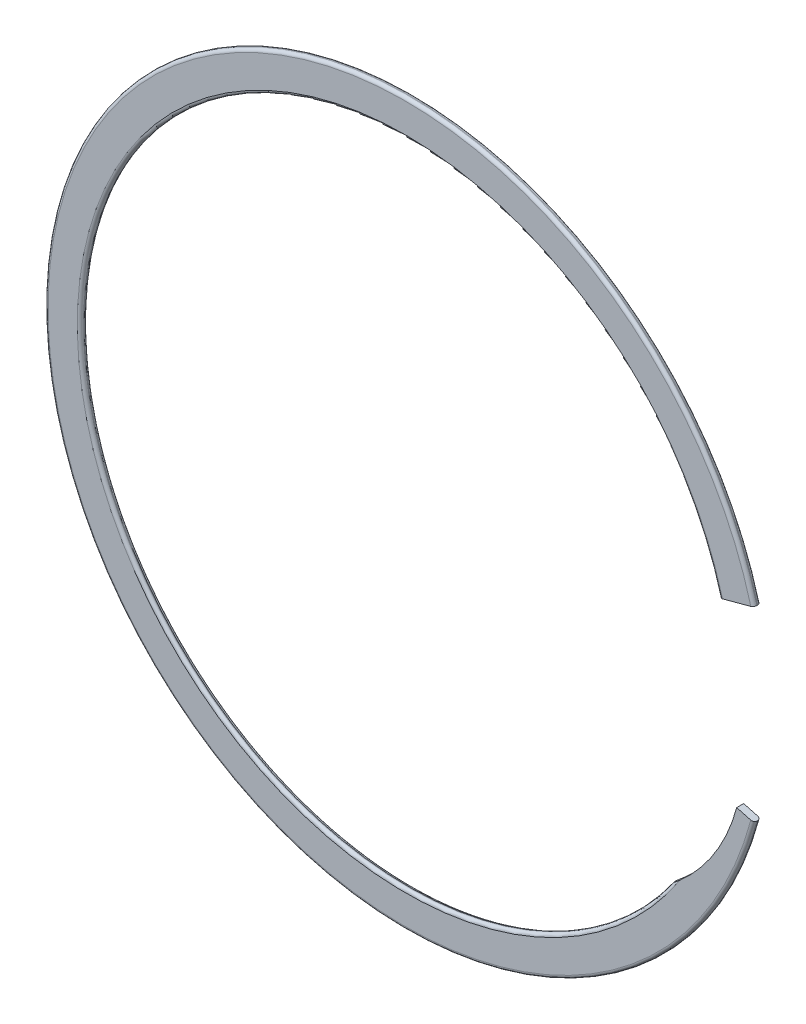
ISO-10303-21;
HEADER;
FILE_DESCRIPTION(('STEP AP214'),'2;1');
FILE_NAME('part.step','',(''),(''),'','','');
FILE_SCHEMA(('AUTOMOTIVE_DESIGN { 1 0 10303 214 1 1 1 1 }'));
ENDSEC;
DATA;
#1=APPLICATION_CONTEXT('core data for automotive mechanical design processes');
#2=APPLICATION_PROTOCOL_DEFINITION('international standard','automotive_design',2000,#1);
#3=PRODUCT_CONTEXT('',#1,'mechanical');
#4=PRODUCT('Part','Part','',(#3));
#5=PRODUCT_RELATED_PRODUCT_CATEGORY('part','',(#4));
#6=PRODUCT_DEFINITION_FORMATION('','',#4);
#7=PRODUCT_DEFINITION_CONTEXT('part definition',#1,'design');
#8=PRODUCT_DEFINITION('design','',#6,#7);
#9=PRODUCT_DEFINITION_SHAPE('','',#8);
#10=(LENGTH_UNIT() NAMED_UNIT(*) SI_UNIT(.MILLI.,.METRE.));
#11=(NAMED_UNIT(*) PLANE_ANGLE_UNIT() SI_UNIT($,.RADIAN.));
#12=(NAMED_UNIT(*) SI_UNIT($,.STERADIAN.) SOLID_ANGLE_UNIT());
#13=UNCERTAINTY_MEASURE_WITH_UNIT(LENGTH_MEASURE(1.E-05),#10,'distance_accuracy_value','');
#14=(GEOMETRIC_REPRESENTATION_CONTEXT(3) GLOBAL_UNCERTAINTY_ASSIGNED_CONTEXT((#13)) GLOBAL_UNIT_ASSIGNED_CONTEXT((#10,
#11,#12)) REPRESENTATION_CONTEXT('',''));
#15=CARTESIAN_POINT('',(0.,0.,0.));
#16=DIRECTION('',(0.,0.,1.));
#17=DIRECTION('',(1.,0.,0.));
#18=AXIS2_PLACEMENT_3D('',#15,#16,#17);
#19=CARTESIAN_POINT('',(0.,0.,0.3937));
#20=DIRECTION('',(0.,0.,-1.));
#21=DIRECTION('',(-1.,0.,0.));
#22=AXIS2_PLACEMENT_3D('',#19,#20,#21);
#23=CYLINDRICAL_SURFACE('',#22,36.7284);
#24=DIRECTION('',(0.,0.,-1.));
#25=VECTOR('',#24,1.);
#26=CARTESIAN_POINT('',(30.0454235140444,-21.1245802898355,0.3937));
#27=LINE('',#26,#25);
#28=CARTESIAN_POINT('',(30.0454235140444,-21.1245802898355,0.0393699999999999));
#29=VERTEX_POINT('',#28);
#30=CARTESIAN_POINT('',(30.0454235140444,-21.1245802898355,-0.0393699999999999));
#31=VERTEX_POINT('',#30);
#32=EDGE_CURVE('E127',#29,#31,#27,.T.);
#33=ORIENTED_EDGE('',*,*,#32,.T.);
#34=CARTESIAN_POINT('',(0.,0.,-0.0393699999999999));
#35=DIRECTION('',(0.,0.,1.));
#36=DIRECTION('',(1.,0.,0.));
#37=AXIS2_PLACEMENT_3D('',#34,#35,#36);
#38=CIRCLE('',#37,36.7284);
#39=CARTESIAN_POINT('',(35.4769101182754,9.50600941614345,-0.0393699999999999));
#40=VERTEX_POINT('',#39);
#41=EDGE_CURVE('E153',#31,#40,#38,.F.);
#42=ORIENTED_EDGE('',*,*,#41,.T.);
#43=DIRECTION('',(0.,0.,-1.));
#44=VECTOR('',#43,1.);
#45=CARTESIAN_POINT('',(35.4769101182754,9.50600941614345,0.3937));
#46=LINE('',#45,#44);
#47=CARTESIAN_POINT('',(35.4769101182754,9.50600941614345,0.0393699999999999));
#48=VERTEX_POINT('',#47);
#49=EDGE_CURVE('E148',#48,#40,#46,.T.);
#50=ORIENTED_EDGE('',*,*,#49,.F.);
#51=CARTESIAN_POINT('',(0.,0.,0.0393699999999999));
#52=DIRECTION('',(0.,0.,1.));
#53=DIRECTION('',(1.,0.,0.));
#54=AXIS2_PLACEMENT_3D('',#51,#52,#53);
#55=CIRCLE('',#54,36.7284);
#56=EDGE_CURVE('E151',#48,#29,#55,.T.);
#57=ORIENTED_EDGE('',*,*,#56,.T.);
#58=EDGE_LOOP('',(#33,#42,#50,#57));
#59=FACE_BOUND('',#58,.T.);
#60=ADVANCED_FACE('F36',(#59),#23,.F.);
#61=CARTESIAN_POINT('',(35.4769101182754,9.50600941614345,0.3937));
#62=DIRECTION('',(-0.258819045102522,0.965925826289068,0.));
#63=DIRECTION('',(-0.965925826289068,-0.258819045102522,0.));
#64=AXIS2_PLACEMENT_3D('',#61,#62,#63);
#65=PLANE('',#64);
#66=ORIENTED_EDGE('',*,*,#49,.T.);
#67=CARTESIAN_POINT('',(35.8191666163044,9.59771676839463,-0.0393699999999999));
#68=DIRECTION('',(-0.258819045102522,0.965925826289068,0.));
#69=DIRECTION('',(-0.965925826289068,-0.258819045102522,0.));
#70=AXIS2_PLACEMENT_3D('',#67,#68,#69);
#71=CIRCLE('',#70,0.35433);
#72=CARTESIAN_POINT('',(35.8191666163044,9.59771676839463,-0.3937));
#73=VERTEX_POINT('',#72);
#74=EDGE_CURVE('E162',#40,#73,#71,.F.);
#75=ORIENTED_EDGE('',*,*,#74,.T.);
#76=DIRECTION('',(0.965925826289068,0.258819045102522,0.));
#77=VECTOR('',#76,1.);
#78=CARTESIAN_POINT('',(35.4769101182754,9.50600941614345,-0.3937));
#79=LINE('',#78,#77);
#80=CARTESIAN_POINT('',(39.0111071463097,10.4529946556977,-0.3937));
#81=VERTEX_POINT('',#80);
#82=EDGE_CURVE('E138',#73,#81,#79,.T.);
#83=ORIENTED_EDGE('',*,*,#82,.T.);
#84=CARTESIAN_POINT('',(39.0111071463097,10.4529946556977,-0.0393699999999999));
#85=DIRECTION('',(-0.258819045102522,0.965925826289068,0.));
#86=DIRECTION('',(-0.965925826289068,-0.258819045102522,0.));
#87=AXIS2_PLACEMENT_3D('',#84,#85,#86);
#88=CIRCLE('',#87,0.35433);
#89=CARTESIAN_POINT('',(39.3533636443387,10.5447020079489,-0.0393699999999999));
#90=VERTEX_POINT('',#89);
#91=EDGE_CURVE('E158',#81,#90,#88,.F.);
#92=ORIENTED_EDGE('',*,*,#91,.T.);
#93=DIRECTION('',(0.,0.,-1.));
#94=VECTOR('',#93,1.);
#95=CARTESIAN_POINT('',(39.3533636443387,10.5447020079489,0.3937));
#96=LINE('',#95,#94);
#97=CARTESIAN_POINT('',(39.3533636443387,10.5447020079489,0.0393699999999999));
#98=VERTEX_POINT('',#97);
#99=EDGE_CURVE('E145',#98,#90,#96,.T.);
#100=ORIENTED_EDGE('',*,*,#99,.F.);
#101=CARTESIAN_POINT('',(39.0111071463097,10.4529946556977,0.0393699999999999));
#102=DIRECTION('',(-0.258819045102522,0.965925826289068,0.));
#103=DIRECTION('',(-0.965925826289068,-0.258819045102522,0.));
#104=AXIS2_PLACEMENT_3D('',#101,#102,#103);
#105=CIRCLE('',#104,0.35433);
#106=CARTESIAN_POINT('',(39.0111071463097,10.4529946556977,0.3937));
#107=VERTEX_POINT('',#106);
#108=EDGE_CURVE('E156',#98,#107,#105,.F.);
#109=ORIENTED_EDGE('',*,*,#108,.T.);
#110=DIRECTION('',(0.965925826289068,0.258819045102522,0.));
#111=VECTOR('',#110,1.);
#112=CARTESIAN_POINT('',(35.4769101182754,9.50600941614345,0.3937));
#113=LINE('',#112,#111);
#114=CARTESIAN_POINT('',(35.8191666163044,9.59771676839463,0.3937));
#115=VERTEX_POINT('',#114);
#116=EDGE_CURVE('E116',#115,#107,#113,.T.);
#117=ORIENTED_EDGE('',*,*,#116,.F.);
#118=CARTESIAN_POINT('',(35.8191666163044,9.59771676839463,0.0393699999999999));
#119=DIRECTION('',(-0.258819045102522,0.965925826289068,0.));
#120=DIRECTION('',(-0.965925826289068,-0.258819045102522,0.));
#121=AXIS2_PLACEMENT_3D('',#118,#119,#120);
#122=CIRCLE('',#121,0.35433);
#123=EDGE_CURVE('E160',#115,#48,#122,.F.);
#124=ORIENTED_EDGE('',*,*,#123,.T.);
#125=EDGE_LOOP('',(#66,#75,#83,#92,#100,#109,#117,#124));
#126=FACE_BOUND('',#125,.T.);
#127=ADVANCED_FACE('F194',(#126),#65,.F.);
#128=CARTESIAN_POINT('',(0.,0.,0.3937));
#129=DIRECTION('',(0.,0.,-1.));
#130=DIRECTION('',(-1.,0.,0.));
#131=AXIS2_PLACEMENT_3D('',#128,#129,#130);
#132=CYLINDRICAL_SURFACE('',#131,40.7416);
#133=ORIENTED_EDGE('',*,*,#99,.T.);
#134=CARTESIAN_POINT('',(0.,0.,-0.0393699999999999));
#135=DIRECTION('',(0.,0.,1.));
#136=DIRECTION('',(1.,0.,0.));
#137=AXIS2_PLACEMENT_3D('',#134,#135,#136);
#138=CIRCLE('',#137,40.7416);
#139=CARTESIAN_POINT('',(39.3533636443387,-10.5447020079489,-0.0393699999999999));
#140=VERTEX_POINT('',#139);
#141=EDGE_CURVE('E220',#90,#140,#138,.T.);
#142=ORIENTED_EDGE('',*,*,#141,.T.);
#143=DIRECTION('',(0.,0.,-1.));
#144=VECTOR('',#143,1.);
#145=CARTESIAN_POINT('',(39.3533636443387,-10.5447020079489,0.3937));
#146=LINE('',#145,#144);
#147=CARTESIAN_POINT('',(39.3533636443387,-10.5447020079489,0.0393699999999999));
#148=VERTEX_POINT('',#147);
#149=EDGE_CURVE('E126',#148,#140,#146,.T.);
#150=ORIENTED_EDGE('',*,*,#149,.F.);
#151=CARTESIAN_POINT('',(0.,0.,0.0393699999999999));
#152=DIRECTION('',(0.,0.,1.));
#153=DIRECTION('',(1.,0.,0.));
#154=AXIS2_PLACEMENT_3D('',#151,#152,#153);
#155=CIRCLE('',#154,40.7416);
#156=EDGE_CURVE('E216',#148,#98,#155,.F.);
#157=ORIENTED_EDGE('',*,*,#156,.T.);
#158=EDGE_LOOP('',(#133,#142,#150,#157));
#159=FACE_BOUND('',#158,.T.);
#160=ADVANCED_FACE('F191',(#159),#132,.T.);
#161=CARTESIAN_POINT('',(37.4151368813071,-10.0253557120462,0.3937));
#162=DIRECTION('',(-0.258819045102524,-0.965925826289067,0.));
#163=DIRECTION('',(0.965925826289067,-0.258819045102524,0.));
#164=AXIS2_PLACEMENT_3D('',#161,#162,#163);
#165=PLANE('',#164);
#166=ORIENTED_EDGE('',*,*,#149,.T.);
#167=CARTESIAN_POINT('',(39.0111071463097,-10.4529946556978,-0.0393699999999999));
#168=DIRECTION('',(-0.258819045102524,-0.965925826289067,0.));
#169=DIRECTION('',(0.965925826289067,-0.258819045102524,0.));
#170=AXIS2_PLACEMENT_3D('',#167,#168,#169);
#171=CIRCLE('',#170,0.35433);
#172=CARTESIAN_POINT('',(39.0111071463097,-10.4529946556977,-0.3937));
#173=VERTEX_POINT('',#172);
#174=EDGE_CURVE('E11',#140,#173,#171,.F.);
#175=ORIENTED_EDGE('',*,*,#174,.T.);
#176=DIRECTION('',(-0.965925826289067,0.258819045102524,0.));
#177=VECTOR('',#176,1.);
#178=CARTESIAN_POINT('',(37.4151368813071,-10.0253557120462,-0.3937));
#179=LINE('',#178,#177);
#180=CARTESIAN_POINT('',(37.4151368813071,-10.0253557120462,-0.3937));
#181=VERTEX_POINT('',#180);
#182=EDGE_CURVE('E122',#173,#181,#179,.T.);
#183=ORIENTED_EDGE('',*,*,#182,.T.);
#184=DIRECTION('',(0.,0.,-1.));
#185=VECTOR('',#184,1.);
#186=CARTESIAN_POINT('',(37.4151368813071,-10.0253557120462,0.3937));
#187=LINE('',#186,#185);
#188=CARTESIAN_POINT('',(37.4151368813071,-10.0253557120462,0.3937));
#189=VERTEX_POINT('',#188);
#190=EDGE_CURVE('E119',#189,#181,#187,.T.);
#191=ORIENTED_EDGE('',*,*,#190,.F.);
#192=DIRECTION('',(-0.965925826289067,0.258819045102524,0.));
#193=VECTOR('',#192,1.);
#194=CARTESIAN_POINT('',(37.4151368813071,-10.0253557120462,0.3937));
#195=LINE('',#194,#193);
#196=CARTESIAN_POINT('',(39.0111071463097,-10.4529946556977,0.3937));
#197=VERTEX_POINT('',#196);
#198=EDGE_CURVE('E106',#197,#189,#195,.T.);
#199=ORIENTED_EDGE('',*,*,#198,.F.);
#200=CARTESIAN_POINT('',(39.0111071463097,-10.4529946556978,0.0393699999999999));
#201=DIRECTION('',(-0.258819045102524,-0.965925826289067,0.));
#202=DIRECTION('',(0.965925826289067,-0.258819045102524,0.));
#203=AXIS2_PLACEMENT_3D('',#200,#201,#202);
#204=CIRCLE('',#203,0.35433);
#205=EDGE_CURVE('E44',#197,#148,#204,.F.);
#206=ORIENTED_EDGE('',*,*,#205,.T.);
#207=EDGE_LOOP('',(#166,#175,#183,#191,#199,#206));
#208=FACE_BOUND('',#207,.T.);
#209=ADVANCED_FACE('F120',(#208),#165,.F.);
#210=CARTESIAN_POINT('',(17.2242613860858,-4.61522692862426,0.3937));
#211=DIRECTION('',(0.,0.,-1.));
#212=DIRECTION('',(-1.,0.,0.));
#213=AXIS2_PLACEMENT_3D('',#210,#211,#212);
#214=CYLINDRICAL_SURFACE('',#213,20.9031324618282);
#215=CARTESIAN_POINT('',(17.2242613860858,-4.61522692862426,-0.3937));
#216=DIRECTION('',(0.,0.,-1.));
#217=DIRECTION('',(1.,0.,0.));
#218=AXIS2_PLACEMENT_3D('',#215,#216,#217);
#219=CIRCLE('',#218,20.9031324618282);
#220=CARTESIAN_POINT('',(31.0205199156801,-20.3188633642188,-0.3937));
#221=VERTEX_POINT('',#220);
#222=EDGE_CURVE('E142',#181,#221,#219,.T.);
#223=ORIENTED_EDGE('',*,*,#222,.T.);
#224=CARTESIAN_POINT('',(31.0205199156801,-20.3188633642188,-0.3937));
#225=CARTESIAN_POINT('',(30.9761520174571,-20.3578431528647,-0.39367635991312));
#226=CARTESIAN_POINT('',(30.9316104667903,-20.3966406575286,-0.392646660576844));
#227=CARTESIAN_POINT('',(30.8421947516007,-20.4738626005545,-0.388327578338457));
#228=CARTESIAN_POINT('',(30.7973201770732,-20.5122863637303,-0.38503467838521));
#229=CARTESIAN_POINT('',(30.7070594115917,-20.5889126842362,-0.375906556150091));
#230=CARTESIAN_POINT('',(30.6616718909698,-20.6271115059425,-0.370052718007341));
#231=CARTESIAN_POINT('',(30.5708829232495,-20.7028659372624,-0.355320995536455));
#232=CARTESIAN_POINT('',(30.5254815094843,-20.7404219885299,-0.346445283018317));
#233=CARTESIAN_POINT('',(30.4545207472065,-20.7986224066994,-0.32947622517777));
#234=CARTESIAN_POINT('',(30.4288779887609,-20.8195514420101,-0.322706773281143));
#235=CARTESIAN_POINT('',(30.377801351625,-20.8610390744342,-0.307649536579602));
#236=CARTESIAN_POINT('',(30.352367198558,-20.8815982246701,-0.299364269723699));
#237=CARTESIAN_POINT('',(30.3092904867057,-20.9162539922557,-0.283584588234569));
#238=CARTESIAN_POINT('',(30.2915636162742,-20.9304672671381,-0.276578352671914));
#239=CARTESIAN_POINT('',(30.2563380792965,-20.9586180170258,-0.261355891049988));
#240=CARTESIAN_POINT('',(30.2388399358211,-20.9725548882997,-0.253137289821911));
#241=CARTESIAN_POINT('',(30.2027879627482,-21.0011773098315,-0.234377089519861));
#242=CARTESIAN_POINT('',(30.1842744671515,-21.0158227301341,-0.223695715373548));
#243=CARTESIAN_POINT('',(30.1482506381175,-21.0442246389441,-0.199811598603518));
#244=CARTESIAN_POINT('',(30.1307364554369,-21.0579845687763,-0.186619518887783));
#245=CARTESIAN_POINT('',(30.1078462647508,-21.0759151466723,-0.165507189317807));
#246=CARTESIAN_POINT('',(30.1015502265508,-21.0808407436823,-0.159241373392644));
#247=CARTESIAN_POINT('',(30.0894386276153,-21.0903056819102,-0.145935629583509));
#248=CARTESIAN_POINT('',(30.0836245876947,-21.0948438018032,-0.138893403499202));
#249=CARTESIAN_POINT('',(30.0726662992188,-21.1033889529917,-0.12378388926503));
#250=CARTESIAN_POINT('',(30.0675340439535,-21.1073864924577,-0.11570220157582));
#251=CARTESIAN_POINT('',(30.0585287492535,-21.1143953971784,-0.0985304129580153));
#252=CARTESIAN_POINT('',(30.0546448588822,-21.1174152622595,-0.089449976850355));
#253=CARTESIAN_POINT('',(30.0497064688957,-21.1212534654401,-0.0735078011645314));
#254=CARTESIAN_POINT('',(30.0481410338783,-21.1224695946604,-0.0669055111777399));
#255=CARTESIAN_POINT('',(30.045981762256,-21.1241467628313,-0.0533405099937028));
#256=CARTESIAN_POINT('',(30.0454046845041,-21.1245947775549,-0.0463736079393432));
#257=CARTESIAN_POINT('',(30.0454235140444,-21.1245802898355,-0.0393699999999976));
#258=B_SPLINE_CURVE_WITH_KNOTS('',3,(#224,#225,#226,#227,#228,#229,#230,#231,#232,#233,#234,
#235,#236,#237,#238,#239,#240,#241,#242,#243,#244,#245,#246,#247,#248,#249,#250,#251,#252,#253,
#254,#255,#256,#257),.UNSPECIFIED.,.F.,.F.,(4,2,2,2,2,2,2,2,2,2,2,2,2,2,2,2,4),(0.,
0.177183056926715,0.354642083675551,0.533413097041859,0.712055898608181,0.813383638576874,
0.914544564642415,0.985851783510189,1.05730060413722,1.13495595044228,1.21228857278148,
1.24272476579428,1.27325360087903,1.30426333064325,1.33499573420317,1.35556401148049,
1.37647771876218),.UNSPECIFIED.);
#259=EDGE_CURVE('E174',#221,#31,#258,.T.);
#260=ORIENTED_EDGE('',*,*,#259,.T.);
#261=ORIENTED_EDGE('',*,*,#32,.F.);
#262=CARTESIAN_POINT('',(30.0454235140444,-21.1245802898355,0.0393699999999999));
#263=CARTESIAN_POINT('',(30.0454050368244,-21.1245945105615,0.046294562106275));
#264=CARTESIAN_POINT('',(30.0459691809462,-21.1241565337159,0.0531849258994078));
#265=CARTESIAN_POINT('',(30.0480843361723,-21.122513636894,0.0666201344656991));
#266=CARTESIAN_POINT('',(30.049620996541,-21.1213198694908,0.0731685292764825));
#267=CARTESIAN_POINT('',(30.0539891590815,-21.1179249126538,0.0874088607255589));
#268=CARTESIAN_POINT('',(30.0570458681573,-21.1155483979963,0.0949871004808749));
#269=CARTESIAN_POINT('',(30.0640736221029,-21.1100803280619,0.109461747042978));
#270=CARTESIAN_POINT('',(30.0680499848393,-21.1069846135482,0.116353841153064));
#271=CARTESIAN_POINT('',(30.0798331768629,-21.0978028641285,0.134378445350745));
#272=CARTESIAN_POINT('',(30.0882801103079,-21.0912123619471,0.144825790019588));
#273=CARTESIAN_POINT('',(30.1061922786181,-21.0772114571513,0.164143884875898));
#274=CARTESIAN_POINT('',(30.1156597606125,-21.0697992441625,0.173011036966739));
#275=CARTESIAN_POINT('',(30.1399026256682,-21.0507827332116,0.193542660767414));
#276=CARTESIAN_POINT('',(30.1550378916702,-21.0388791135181,0.20449689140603));
#277=CARTESIAN_POINT('',(30.1860063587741,-21.0144496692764,0.224602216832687));
#278=CARTESIAN_POINT('',(30.2018410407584,-21.0019225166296,0.233749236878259));
#279=CARTESIAN_POINT('',(30.2340874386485,-20.9763332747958,0.250772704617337));
#280=CARTESIAN_POINT('',(30.250503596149,-20.963266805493,0.258634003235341));
#281=CARTESIAN_POINT('',(30.2835675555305,-20.9368664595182,0.273253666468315));
#282=CARTESIAN_POINT('',(30.3002150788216,-20.9235328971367,0.280013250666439));
#283=CARTESIAN_POINT('',(30.3471577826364,-20.8858150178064,0.29774308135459));
#284=CARTESIAN_POINT('',(30.3776350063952,-20.8611882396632,0.307714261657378));
#285=CARTESIAN_POINT('',(30.4388295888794,-20.8114515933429,0.325507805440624));
#286=CARTESIAN_POINT('',(30.4695470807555,-20.786341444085,0.333328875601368));
#287=CARTESIAN_POINT('',(30.5620113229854,-20.7103114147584,0.354266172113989));
#288=CARTESIAN_POINT('',(30.6238891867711,-20.6588370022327,0.36479510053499));
#289=CARTESIAN_POINT('',(30.7419779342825,-20.5594334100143,0.380100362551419));
#290=CARTESIAN_POINT('',(30.7982103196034,-20.5115887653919,0.38529989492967));
#291=CARTESIAN_POINT('',(30.8820679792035,-20.439468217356,0.390394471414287));
#292=CARTESIAN_POINT('',(30.9098415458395,-20.4154544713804,0.391642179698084));
#293=CARTESIAN_POINT('',(30.9652713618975,-20.3672725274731,0.393293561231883));
#294=CARTESIAN_POINT('',(30.9929276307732,-20.3431043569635,0.393697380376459));
#295=CARTESIAN_POINT('',(31.0205199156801,-20.3188633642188,0.3937));
#296=B_SPLINE_CURVE_WITH_KNOTS('',3,(#262,#263,#264,#265,#266,#267,#268,#269,#270,#271,#272,
#273,#274,#275,#276,#277,#278,#279,#280,#281,#282,#283,#284,#285,#286,#287,#288,#289,#290,#291,
#292,#293,#294,#295),.UNSPECIFIED.,.F.,.F.,(4,2,2,2,2,2,2,2,2,2,2,2,2,2,2,2,4),(0.,
0.0206821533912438,0.0410660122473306,0.0664517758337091,0.0919881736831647,0.13662934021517,
0.181370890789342,0.247666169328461,0.31410926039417,0.381286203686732,0.448388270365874,
0.56959056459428,0.690865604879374,0.934131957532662,1.15608394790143,1.26628477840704,
1.37646655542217),.UNSPECIFIED.);
#297=CARTESIAN_POINT('',(31.0205199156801,-20.3188633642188,0.3937));
#298=VERTEX_POINT('',#297);
#299=EDGE_CURVE('E132',#29,#298,#296,.T.);
#300=ORIENTED_EDGE('',*,*,#299,.T.);
#301=CARTESIAN_POINT('',(17.2242613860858,-4.61522692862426,0.3937));
#302=DIRECTION('',(0.,0.,-1.));
#303=DIRECTION('',(1.,0.,0.));
#304=AXIS2_PLACEMENT_3D('',#301,#302,#303);
#305=CIRCLE('',#304,20.9031324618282);
#306=EDGE_CURVE('E111',#189,#298,#305,.T.);
#307=ORIENTED_EDGE('',*,*,#306,.F.);
#308=ORIENTED_EDGE('',*,*,#190,.T.);
#309=EDGE_LOOP('',(#223,#260,#261,#300,#307,#308));
#310=FACE_BOUND('',#309,.T.);
#311=ADVANCED_FACE('F129',(#310),#214,.F.);
#312=CARTESIAN_POINT('',(0.,0.,0.3937));
#313=DIRECTION('',(0.,0.,1.));
#314=DIRECTION('',(1.,0.,0.));
#315=AXIS2_PLACEMENT_3D('',#312,#313,#314);
#316=PLANE('',#315);
#317=ORIENTED_EDGE('',*,*,#306,.T.);
#318=CARTESIAN_POINT('',(0.,0.,0.3937));
#319=DIRECTION('',(0.,0.,1.));
#320=DIRECTION('',(1.,0.,0.));
#321=AXIS2_PLACEMENT_3D('',#318,#319,#320);
#322=CIRCLE('',#321,37.08273);
#323=EDGE_CURVE('E215',#298,#115,#322,.F.);
#324=ORIENTED_EDGE('',*,*,#323,.T.);
#325=ORIENTED_EDGE('',*,*,#116,.T.);
#326=CARTESIAN_POINT('',(0.,0.,0.3937));
#327=DIRECTION('',(0.,0.,1.));
#328=DIRECTION('',(1.,0.,0.));
#329=AXIS2_PLACEMENT_3D('',#326,#327,#328);
#330=CIRCLE('',#329,40.38727);
#331=EDGE_CURVE('E115',#107,#197,#330,.T.);
#332=ORIENTED_EDGE('',*,*,#331,.T.);
#333=ORIENTED_EDGE('',*,*,#198,.T.);
#334=EDGE_LOOP('',(#317,#324,#325,#332,#333));
#335=FACE_BOUND('',#334,.T.);
#336=ADVANCED_FACE('F108',(#335),#316,.T.);
#337=CARTESIAN_POINT('',(0.,0.,-0.3937));
#338=DIRECTION('',(0.,0.,1.));
#339=DIRECTION('',(1.,0.,0.));
#340=AXIS2_PLACEMENT_3D('',#337,#338,#339);
#341=PLANE('',#340);
#342=ORIENTED_EDGE('',*,*,#82,.F.);
#343=CARTESIAN_POINT('',(0.,0.,-0.3937));
#344=DIRECTION('',(0.,0.,1.));
#345=DIRECTION('',(1.,0.,0.));
#346=AXIS2_PLACEMENT_3D('',#343,#344,#345);
#347=CIRCLE('',#346,37.08273);
#348=EDGE_CURVE('E166',#73,#221,#347,.T.);
#349=ORIENTED_EDGE('',*,*,#348,.T.);
#350=ORIENTED_EDGE('',*,*,#222,.F.);
#351=ORIENTED_EDGE('',*,*,#182,.F.);
#352=CARTESIAN_POINT('',(0.,0.,-0.3937));
#353=DIRECTION('',(0.,0.,1.));
#354=DIRECTION('',(1.,0.,0.));
#355=AXIS2_PLACEMENT_3D('',#352,#353,#354);
#356=CIRCLE('',#355,40.38727);
#357=EDGE_CURVE('E164',#173,#81,#356,.F.);
#358=ORIENTED_EDGE('',*,*,#357,.T.);
#359=EDGE_LOOP('',(#342,#349,#350,#351,#358));
#360=FACE_BOUND('',#359,.T.);
#361=ADVANCED_FACE('F186',(#360),#341,.F.);
#362=CARTESIAN_POINT('',(0.,0.,-0.0393699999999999));
#363=DIRECTION('',(0.,0.,1.));
#364=DIRECTION('',(1.,0.,0.));
#365=AXIS2_PLACEMENT_3D('',#362,#363,#364);
#366=TOROIDAL_SURFACE('',#365,37.08273,0.35433);
#367=ORIENTED_EDGE('',*,*,#259,.F.);
#368=ORIENTED_EDGE('',*,*,#348,.F.);
#369=ORIENTED_EDGE('',*,*,#74,.F.);
#370=ORIENTED_EDGE('',*,*,#41,.F.);
#371=EDGE_LOOP('',(#367,#368,#369,#370));
#372=FACE_BOUND('',#371,.T.);
#373=ADVANCED_FACE('F201',(#372),#366,.T.);
#374=CARTESIAN_POINT('',(0.,0.,0.0393699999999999));
#375=DIRECTION('',(0.,0.,1.));
#376=DIRECTION('',(1.,0.,0.));
#377=AXIS2_PLACEMENT_3D('',#374,#375,#376);
#378=TOROIDAL_SURFACE('',#377,37.08273,0.35433);
#379=ORIENTED_EDGE('',*,*,#299,.F.);
#380=ORIENTED_EDGE('',*,*,#56,.F.);
#381=ORIENTED_EDGE('',*,*,#123,.F.);
#382=ORIENTED_EDGE('',*,*,#323,.F.);
#383=EDGE_LOOP('',(#379,#380,#381,#382));
#384=FACE_BOUND('',#383,.T.);
#385=ADVANCED_FACE('F180',(#384),#378,.T.);
#386=CARTESIAN_POINT('',(0.,0.,-0.0393699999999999));
#387=DIRECTION('',(0.,0.,1.));
#388=DIRECTION('',(1.,0.,0.));
#389=AXIS2_PLACEMENT_3D('',#386,#387,#388);
#390=TOROIDAL_SURFACE('',#389,40.38727,0.35433);
#391=ORIENTED_EDGE('',*,*,#91,.F.);
#392=ORIENTED_EDGE('',*,*,#357,.F.);
#393=ORIENTED_EDGE('',*,*,#174,.F.);
#394=ORIENTED_EDGE('',*,*,#141,.F.);
#395=EDGE_LOOP('',(#391,#392,#393,#394));
#396=FACE_BOUND('',#395,.T.);
#397=ADVANCED_FACE('F209',(#396),#390,.T.);
#398=CARTESIAN_POINT('',(0.,0.,0.0393699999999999));
#399=DIRECTION('',(0.,0.,1.));
#400=DIRECTION('',(1.,0.,0.));
#401=AXIS2_PLACEMENT_3D('',#398,#399,#400);
#402=TOROIDAL_SURFACE('',#401,40.38727,0.35433);
#403=ORIENTED_EDGE('',*,*,#108,.F.);
#404=ORIENTED_EDGE('',*,*,#156,.F.);
#405=ORIENTED_EDGE('',*,*,#205,.F.);
#406=ORIENTED_EDGE('',*,*,#331,.F.);
#407=EDGE_LOOP('',(#403,#404,#405,#406));
#408=FACE_BOUND('',#407,.T.);
#409=ADVANCED_FACE('F38',(#408),#402,.T.);
#410=CLOSED_SHELL('',(#60,#127,#160,#209,#311,#336,#361,#373,#385,#397,#409));
#411=MANIFOLD_SOLID_BREP('B2',#410);
#412=ADVANCED_BREP_SHAPE_REPRESENTATION('',(#18,#411),#14);
#413=SHAPE_DEFINITION_REPRESENTATION(#9,#412);
ENDSEC;
END-ISO-10303-21;
